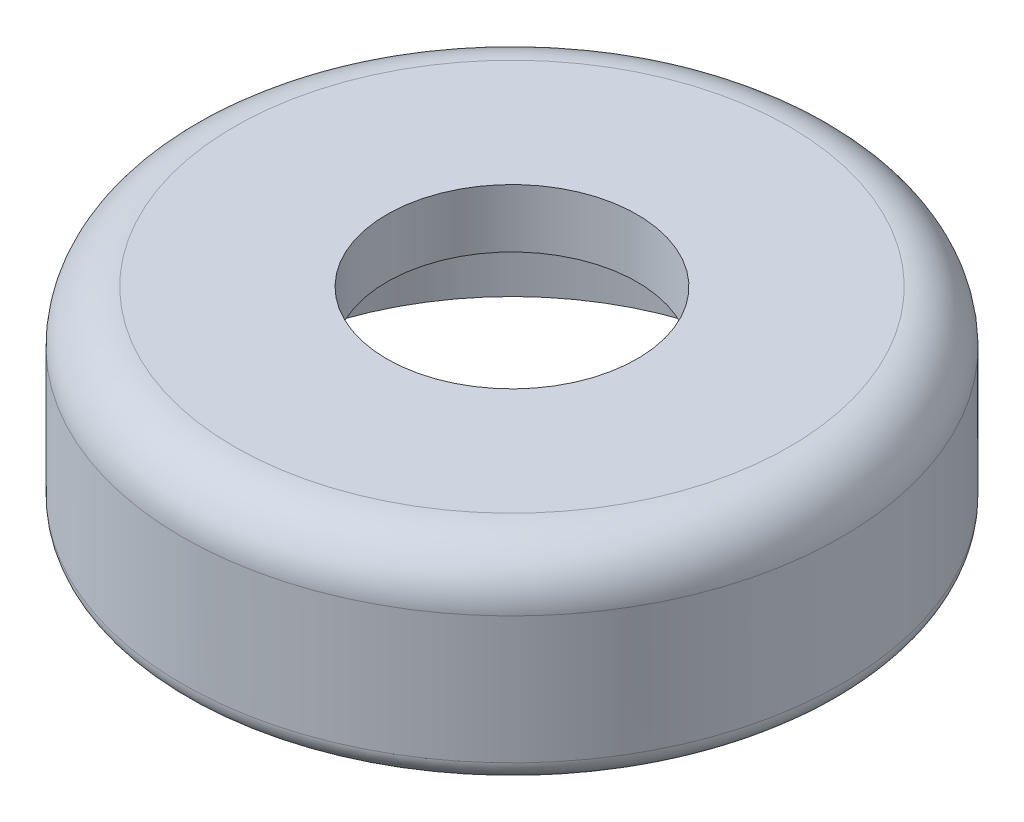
from build123d import *

# Parameters (mm, degrees)
FILLET1_R          = 1.5875
SKETCH2_R          = 3.81
CUT_EXTRUDE1_DEPTH = 16.442907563
FILLET2_R          = 0.635


with BuildPart() as part:
    # Sketch1 → Base-Revolve (revolve)
    with BuildSketch(Plane.XY, mode=Mode.PRIVATE) as base_revolve_sk:
        Polygon((-8.255, 0), (-10.033, 0), (-10.033, 6.096), (0, 6.096), (0, 4.318), (-8.255, 4.318), align=None)
    revolve(base_revolve_sk.sketch.rotate(Axis((0, 0, 0), (0, 1, 0)), 270), axis=Axis((0, 0, 0), (0, 1, 0)))

    # Fillet1
    fillet1_edges = [part.edges().sort_by_distance(p)[0] for p in [
        (0, 6.096, 10.033),
    ]]
    fillet(fillet1_edges, radius=FILLET1_R)

    # Sketch2 → Cut-Extrude1 (cut, through all)
    with BuildSketch(Plane(origin=(0, 6.096, 0), x_dir=(-1, 0, 0), z_dir=(0, 1, 0))):
        with Locations(Location((0, 0, 0), (0, 0, 90))):
            Circle(SKETCH2_R)
    extrude(amount=-CUT_EXTRUDE1_DEPTH, mode=Mode.SUBTRACT)

    # Fillet2
    fillet2_edges = [part.edges().sort_by_distance(p)[0] for p in [
        (0, 0, 10.033),
    ]]
    fillet(fillet2_edges, radius=FILLET2_R)


solid = part.part
